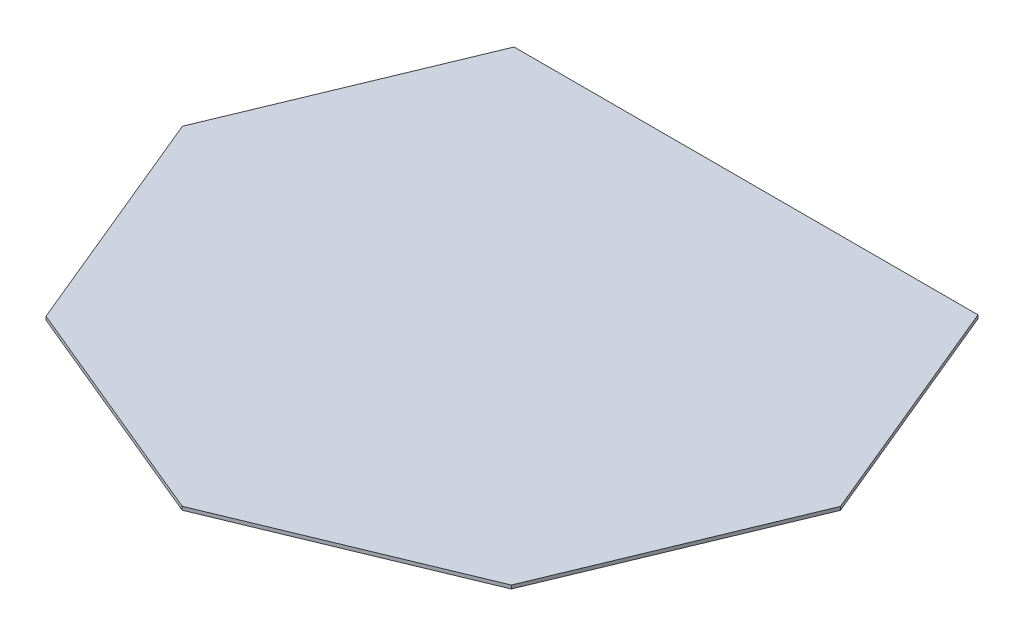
from build123d import *

# Parameters (mm, degrees)
BOSS_EXTRU_1_DEPTH = 10


with BuildPart() as part:
    # Esquisse1 → Boss.-Extru.1 (new body)
    with BuildSketch(Plane(origin=(0, 0, 0), x_dir=(1, 0, 0), z_dir=(0, 1, 0))):
        Polygon((-675.580964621, 683.278607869), (675.81542083, 683.278607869), (958.721392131, -0.278607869), (677.721392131, -678.115403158), (-0.278607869, -958.721392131), (-678.115403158, -677.721392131), (-958.721392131, 0.278607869), align=None)
    extrude(amount=BOSS_EXTRU_1_DEPTH)


solid = part.part
